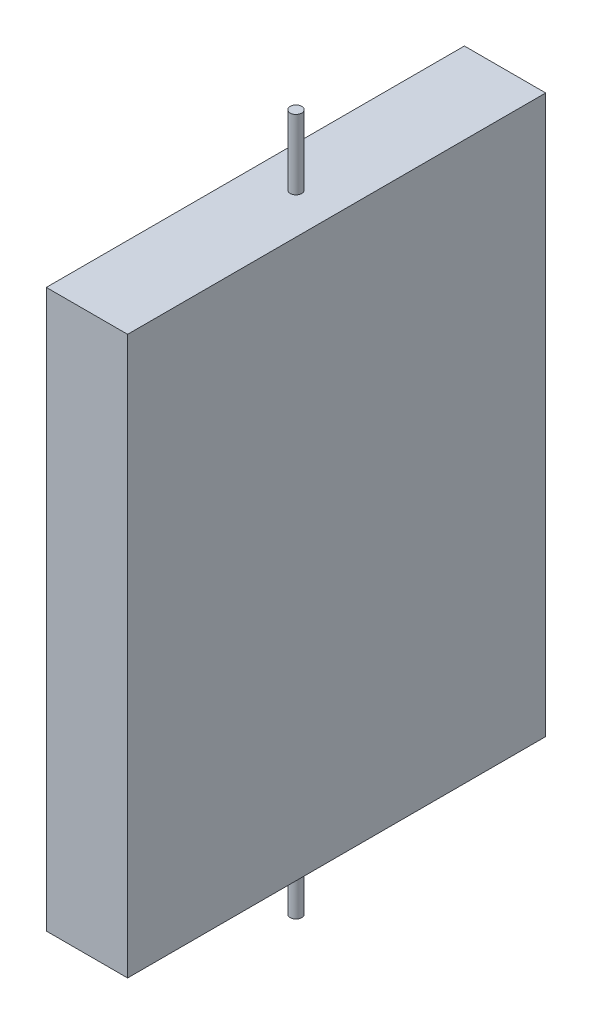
ISO-10303-21;
HEADER;
FILE_DESCRIPTION(('STEP AP214'),'2;1');
FILE_NAME('part.step','',(''),(''),'','','');
FILE_SCHEMA(('AUTOMOTIVE_DESIGN { 1 0 10303 214 1 1 1 1 }'));
ENDSEC;
DATA;
#1=APPLICATION_CONTEXT('core data for automotive mechanical design processes');
#2=APPLICATION_PROTOCOL_DEFINITION('international standard','automotive_design',2000,#1);
#3=PRODUCT_CONTEXT('',#1,'mechanical');
#4=PRODUCT('Part','Part','',(#3));
#5=PRODUCT_RELATED_PRODUCT_CATEGORY('part','',(#4));
#6=PRODUCT_DEFINITION_FORMATION('','',#4);
#7=PRODUCT_DEFINITION_CONTEXT('part definition',#1,'design');
#8=PRODUCT_DEFINITION('design','',#6,#7);
#9=PRODUCT_DEFINITION_SHAPE('','',#8);
#10=(LENGTH_UNIT() NAMED_UNIT(*) SI_UNIT(.MILLI.,.METRE.));
#11=(NAMED_UNIT(*) PLANE_ANGLE_UNIT() SI_UNIT($,.RADIAN.));
#12=(NAMED_UNIT(*) SI_UNIT($,.STERADIAN.) SOLID_ANGLE_UNIT());
#13=UNCERTAINTY_MEASURE_WITH_UNIT(LENGTH_MEASURE(1.E-05),#10,'distance_accuracy_value','');
#14=(GEOMETRIC_REPRESENTATION_CONTEXT(3) GLOBAL_UNCERTAINTY_ASSIGNED_CONTEXT((#13)) GLOBAL_UNIT_ASSIGNED_CONTEXT((#10,
#11,#12)) REPRESENTATION_CONTEXT('',''));
#15=CARTESIAN_POINT('',(0.,0.,0.));
#16=DIRECTION('',(0.,0.,1.));
#17=DIRECTION('',(1.,0.,0.));
#18=AXIS2_PLACEMENT_3D('',#15,#16,#17);
#19=CARTESIAN_POINT('',(-175.,-1200.,-900.));
#20=DIRECTION('',(0.,0.,-1.));
#21=DIRECTION('',(0.,1.,0.));
#22=AXIS2_PLACEMENT_3D('',#19,#20,#21);
#23=PLANE('',#22);
#24=DIRECTION('',(1.,0.,0.));
#25=VECTOR('',#24,1.);
#26=CARTESIAN_POINT('',(-175.,1200.,-900.));
#27=LINE('',#26,#25);
#28=CARTESIAN_POINT('',(-175.,1200.,-900.));
#29=VERTEX_POINT('',#28);
#30=CARTESIAN_POINT('',(175.,1200.,-900.));
#31=VERTEX_POINT('',#30);
#32=EDGE_CURVE('E92',#29,#31,#27,.T.);
#33=ORIENTED_EDGE('',*,*,#32,.T.);
#34=DIRECTION('',(0.,1.,0.));
#35=VECTOR('',#34,1.);
#36=CARTESIAN_POINT('',(175.,-1200.,-900.));
#37=LINE('',#36,#35);
#38=CARTESIAN_POINT('',(175.,-1200.,-900.));
#39=VERTEX_POINT('',#38);
#40=EDGE_CURVE('E94',#39,#31,#37,.T.);
#41=ORIENTED_EDGE('',*,*,#40,.F.);
#42=DIRECTION('',(1.,0.,0.));
#43=VECTOR('',#42,1.);
#44=CARTESIAN_POINT('',(-175.,-1200.,-900.));
#45=LINE('',#44,#43);
#46=CARTESIAN_POINT('',(-175.,-1200.,-900.));
#47=VERTEX_POINT('',#46);
#48=EDGE_CURVE('E56',#47,#39,#45,.T.);
#49=ORIENTED_EDGE('',*,*,#48,.F.);
#50=DIRECTION('',(0.,1.,0.));
#51=VECTOR('',#50,1.);
#52=CARTESIAN_POINT('',(-175.,-1200.,-900.));
#53=LINE('',#52,#51);
#54=EDGE_CURVE('E95',#47,#29,#53,.T.);
#55=ORIENTED_EDGE('',*,*,#54,.T.);
#56=EDGE_LOOP('',(#33,#41,#49,#55));
#57=FACE_BOUND('',#56,.T.);
#58=ADVANCED_FACE('F47',(#57),#23,.T.);
#59=CARTESIAN_POINT('',(-175.,-1200.,900.));
#60=DIRECTION('',(0.,-1.,0.));
#61=DIRECTION('',(0.,0.,-1.));
#62=AXIS2_PLACEMENT_3D('',#59,#60,#61);
#63=PLANE('',#62);
#64=CARTESIAN_POINT('',(0.,-1200.,0.));
#65=DIRECTION('',(0.,-1.,0.));
#66=DIRECTION('',(0.,0.,-1.));
#67=AXIS2_PLACEMENT_3D('',#64,#65,#66);
#68=CIRCLE('',#67,25.);
#69=CARTESIAN_POINT('',(0.,-1200.,-25.));
#70=VERTEX_POINT('',#69);
#71=EDGE_CURVE('E11',#70,#70,#68,.T.);
#72=ORIENTED_EDGE('',*,*,#71,.F.);
#73=EDGE_LOOP('',(#72));
#74=FACE_BOUND('',#73,.T.);
#75=ORIENTED_EDGE('',*,*,#48,.T.);
#76=DIRECTION('',(0.,0.,-1.));
#77=VECTOR('',#76,1.);
#78=CARTESIAN_POINT('',(175.,-1200.,900.));
#79=LINE('',#78,#77);
#80=CARTESIAN_POINT('',(175.,-1200.,900.));
#81=VERTEX_POINT('',#80);
#82=EDGE_CURVE('E109',#81,#39,#79,.T.);
#83=ORIENTED_EDGE('',*,*,#82,.F.);
#84=DIRECTION('',(1.,0.,0.));
#85=VECTOR('',#84,1.);
#86=CARTESIAN_POINT('',(-175.,-1200.,900.));
#87=LINE('',#86,#85);
#88=CARTESIAN_POINT('',(-175.,-1200.,900.));
#89=VERTEX_POINT('',#88);
#90=EDGE_CURVE('E71',#89,#81,#87,.T.);
#91=ORIENTED_EDGE('',*,*,#90,.F.);
#92=DIRECTION('',(0.,0.,-1.));
#93=VECTOR('',#92,1.);
#94=CARTESIAN_POINT('',(-175.,-1200.,900.));
#95=LINE('',#94,#93);
#96=EDGE_CURVE('E101',#89,#47,#95,.T.);
#97=ORIENTED_EDGE('',*,*,#96,.T.);
#98=EDGE_LOOP('',(#75,#83,#91,#97));
#99=FACE_BOUND('',#98,.T.);
#100=ADVANCED_FACE('F167',(#74,#99),#63,.T.);
#101=CARTESIAN_POINT('',(-175.,-1200.,900.));
#102=DIRECTION('',(0.,0.,-1.));
#103=DIRECTION('',(-1.,0.,0.));
#104=AXIS2_PLACEMENT_3D('',#101,#102,#103);
#105=PLANE('',#104);
#106=ORIENTED_EDGE('',*,*,#90,.T.);
#107=DIRECTION('',(0.,1.,0.));
#108=VECTOR('',#107,1.);
#109=CARTESIAN_POINT('',(175.,-1200.,900.));
#110=LINE('',#109,#108);
#111=CARTESIAN_POINT('',(175.,1200.,900.));
#112=VERTEX_POINT('',#111);
#113=EDGE_CURVE('E115',#81,#112,#110,.T.);
#114=ORIENTED_EDGE('',*,*,#113,.T.);
#115=DIRECTION('',(1.,0.,0.));
#116=VECTOR('',#115,1.);
#117=CARTESIAN_POINT('',(-175.,1200.,900.));
#118=LINE('',#117,#116);
#119=CARTESIAN_POINT('',(-175.,1200.,900.));
#120=VERTEX_POINT('',#119);
#121=EDGE_CURVE('E100',#120,#112,#118,.T.);
#122=ORIENTED_EDGE('',*,*,#121,.F.);
#123=DIRECTION('',(0.,1.,0.));
#124=VECTOR('',#123,1.);
#125=CARTESIAN_POINT('',(-175.,-1200.,900.));
#126=LINE('',#125,#124);
#127=EDGE_CURVE('E128',#89,#120,#126,.T.);
#128=ORIENTED_EDGE('',*,*,#127,.F.);
#129=EDGE_LOOP('',(#106,#114,#122,#128));
#130=FACE_BOUND('',#129,.T.);
#131=ADVANCED_FACE('F172',(#130),#105,.F.);
#132=CARTESIAN_POINT('',(-175.,1200.,900.));
#133=DIRECTION('',(0.,-1.,0.));
#134=DIRECTION('',(0.,0.,-1.));
#135=AXIS2_PLACEMENT_3D('',#132,#133,#134);
#136=PLANE('',#135);
#137=CARTESIAN_POINT('',(0.,1200.,0.));
#138=DIRECTION('',(0.,-1.,0.));
#139=DIRECTION('',(0.,0.,-1.));
#140=AXIS2_PLACEMENT_3D('',#137,#138,#139);
#141=CIRCLE('',#140,25.);
#142=CARTESIAN_POINT('',(0.,1200.,-25.));
#143=VERTEX_POINT('',#142);
#144=EDGE_CURVE('E50',#143,#143,#141,.T.);
#145=ORIENTED_EDGE('',*,*,#144,.T.);
#146=EDGE_LOOP('',(#145));
#147=FACE_BOUND('',#146,.T.);
#148=ORIENTED_EDGE('',*,*,#121,.T.);
#149=DIRECTION('',(0.,0.,-1.));
#150=VECTOR('',#149,1.);
#151=CARTESIAN_POINT('',(175.,1200.,900.));
#152=LINE('',#151,#150);
#153=EDGE_CURVE('E107',#112,#31,#152,.T.);
#154=ORIENTED_EDGE('',*,*,#153,.T.);
#155=ORIENTED_EDGE('',*,*,#32,.F.);
#156=DIRECTION('',(0.,0.,-1.));
#157=VECTOR('',#156,1.);
#158=CARTESIAN_POINT('',(-175.,1200.,900.));
#159=LINE('',#158,#157);
#160=EDGE_CURVE('E125',#120,#29,#159,.T.);
#161=ORIENTED_EDGE('',*,*,#160,.F.);
#162=EDGE_LOOP('',(#148,#154,#155,#161));
#163=FACE_BOUND('',#162,.T.);
#164=ADVANCED_FACE('F112',(#147,#163),#136,.F.);
#165=CARTESIAN_POINT('',(-175.,0.,0.));
#166=DIRECTION('',(-1.,0.,0.));
#167=DIRECTION('',(0.,0.,1.));
#168=AXIS2_PLACEMENT_3D('',#165,#166,#167);
#169=PLANE('',#168);
#170=ORIENTED_EDGE('',*,*,#54,.F.);
#171=ORIENTED_EDGE('',*,*,#96,.F.);
#172=ORIENTED_EDGE('',*,*,#127,.T.);
#173=ORIENTED_EDGE('',*,*,#160,.T.);
#174=EDGE_LOOP('',(#170,#171,#172,#173));
#175=FACE_BOUND('',#174,.T.);
#176=ADVANCED_FACE('F181',(#175),#169,.T.);
#177=CARTESIAN_POINT('',(175.,0.,0.));
#178=DIRECTION('',(-1.,0.,0.));
#179=DIRECTION('',(0.,0.,1.));
#180=AXIS2_PLACEMENT_3D('',#177,#178,#179);
#181=PLANE('',#180);
#182=ORIENTED_EDGE('',*,*,#40,.T.);
#183=ORIENTED_EDGE('',*,*,#153,.F.);
#184=ORIENTED_EDGE('',*,*,#113,.F.);
#185=ORIENTED_EDGE('',*,*,#82,.T.);
#186=EDGE_LOOP('',(#182,#183,#184,#185));
#187=FACE_BOUND('',#186,.T.);
#188=ADVANCED_FACE('F105',(#187),#181,.F.);
#189=CARTESIAN_POINT('',(0.,1500.,0.));
#190=DIRECTION('',(0.,1.,0.));
#191=DIRECTION('',(0.,0.,1.));
#192=AXIS2_PLACEMENT_3D('',#189,#190,#191);
#193=PLANE('',#192);
#194=CARTESIAN_POINT('',(0.,1500.,0.));
#195=DIRECTION('',(0.,1.,0.));
#196=DIRECTION('',(0.,0.,1.));
#197=AXIS2_PLACEMENT_3D('',#194,#195,#196);
#198=CIRCLE('',#197,25.);
#199=CARTESIAN_POINT('',(0.,1500.,25.));
#200=VERTEX_POINT('',#199);
#201=EDGE_CURVE('E141',#200,#200,#198,.T.);
#202=ORIENTED_EDGE('',*,*,#201,.T.);
#203=EDGE_LOOP('',(#202));
#204=FACE_BOUND('',#203,.T.);
#205=ADVANCED_FACE('F150',(#204),#193,.T.);
#206=CARTESIAN_POINT('',(0.,-1500.,0.));
#207=DIRECTION('',(0.,1.,0.));
#208=DIRECTION('',(0.,0.,1.));
#209=AXIS2_PLACEMENT_3D('',#206,#207,#208);
#210=CYLINDRICAL_SURFACE('',#209,25.);
#211=ORIENTED_EDGE('',*,*,#201,.F.);
#212=EDGE_LOOP('',(#211));
#213=FACE_BOUND('',#212,.T.);
#214=ORIENTED_EDGE('',*,*,#144,.F.);
#215=EDGE_LOOP('',(#214));
#216=FACE_BOUND('',#215,.T.);
#217=ADVANCED_FACE('F152',(#213,#216),#210,.T.);
#218=ORIENTED_EDGE('',*,*,#71,.T.);
#219=EDGE_LOOP('',(#218));
#220=FACE_BOUND('',#219,.T.);
#221=CARTESIAN_POINT('',(0.,-1500.,0.));
#222=DIRECTION('',(0.,1.,0.));
#223=DIRECTION('',(0.,0.,1.));
#224=AXIS2_PLACEMENT_3D('',#221,#222,#223);
#225=CIRCLE('',#224,25.);
#226=CARTESIAN_POINT('',(0.,-1500.,25.));
#227=VERTEX_POINT('',#226);
#228=EDGE_CURVE('E137',#227,#227,#225,.T.);
#229=ORIENTED_EDGE('',*,*,#228,.T.);
#230=EDGE_LOOP('',(#229));
#231=FACE_BOUND('',#230,.T.);
#232=ADVANCED_FACE('F155',(#220,#231),#210,.T.);
#233=CARTESIAN_POINT('',(0.,-1500.,0.));
#234=DIRECTION('',(0.,1.,0.));
#235=DIRECTION('',(0.,0.,1.));
#236=AXIS2_PLACEMENT_3D('',#233,#234,#235);
#237=PLANE('',#236);
#238=ORIENTED_EDGE('',*,*,#228,.F.);
#239=EDGE_LOOP('',(#238));
#240=FACE_BOUND('',#239,.T.);
#241=ADVANCED_FACE('F160',(#240),#237,.F.);
#242=CLOSED_SHELL('',(#58,#100,#131,#164,#176,#188,#205,#217,#232,#241));
#243=MANIFOLD_SOLID_BREP('B2',#242);
#244=ADVANCED_BREP_SHAPE_REPRESENTATION('',(#18,#243),#14);
#245=SHAPE_DEFINITION_REPRESENTATION(#9,#244);
ENDSEC;
END-ISO-10303-21;
